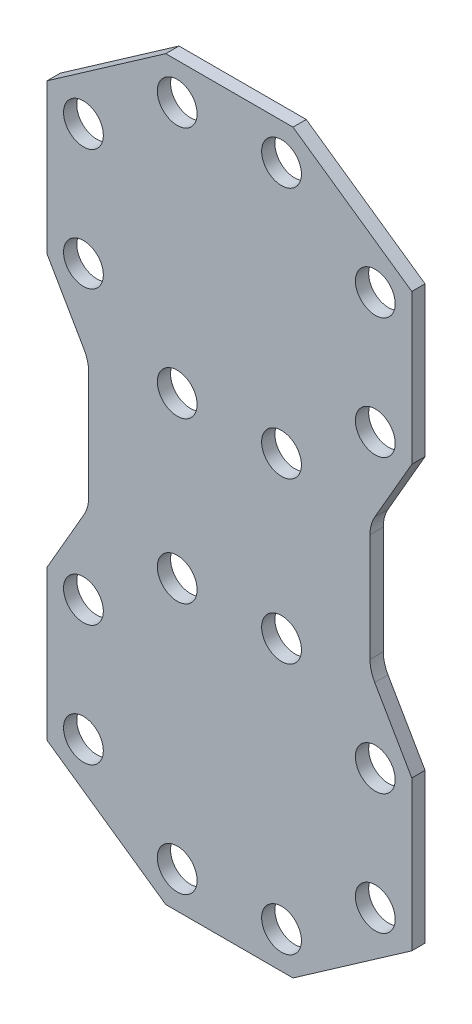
from build123d import *

# Parameters (mm, degrees)
MAIN_PLATE_DEPTH   = 38.1
SKETCH5_R          = 57.15
CUT_EXTRUDE1_DEPTH = 38.1


with BuildPart() as part:
    # Sketch3 → Main Plate (new body)
    with BuildSketch(Plane(origin=(0, 0, 0), x_dir=(0, 1, 0), z_dir=(0, 0, 1))):
        with BuildLine():
            Line((201.663107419, -523.855268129), (-228.234235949, -523.855268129))
            Line((-228.234235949, -523.855268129), (-466.324268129, -182.70492307))
            Line((-466.324268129, -182.70492307), (-466.324268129, 182.70492307))
            Line((-466.324268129, 182.70492307), (-228.234235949, 523.855268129))
            Line((-228.234235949, 523.855268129), (201.663107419, 523.855268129))
            Line((201.663107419, 523.855268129), (385.932842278, 417.467087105))
            ThreePointArc((385.932842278, 417.467087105), (410.436827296, 407.317204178), (436.732842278, 403.855268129))
            Line((436.732842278, 403.855268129), (746.653157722, 403.855268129))
            ThreePointArc((746.653157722, 403.855268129), (772.949172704, 407.317204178), (797.453157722, 417.467087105))
            Line((797.453157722, 417.467087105), (981.722892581, 523.855268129))
            Line((981.722892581, 523.855268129), (1411.620235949, 523.855268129))
            Line((1411.620235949, 523.855268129), (1649.710268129, 182.70492307))
            Line((1649.710268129, 182.70492307), (1649.710268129, -182.70492307))
            Line((1649.710268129, -182.70492307), (1411.620235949, -523.855268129))
            Line((1411.620235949, -523.855268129), (981.722892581, -523.855268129))
            Line((981.722892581, -523.855268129), (797.453157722, -417.467087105))
            ThreePointArc((797.453157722, -417.467087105), (772.949172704, -407.317204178), (746.653157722, -403.855268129))
            Line((746.653157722, -403.855268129), (436.732842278, -403.855268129))
            ThreePointArc((436.732842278, -403.855268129), (410.436827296, -407.317204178), (385.932842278, -417.467087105))
            Line((385.932842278, -417.467087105), (201.663107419, -523.855268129))
        make_face()
    extrude(amount=MAIN_PLATE_DEPTH)

    # Sketch5 → Cut-Extrude1 (cut)
    with BuildSketch(Plane(origin=(0, 0, 0), x_dir=(0, 1, 0), z_dir=(0, 0, 1))):
        with Locations(Location((-173.588730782, 419.080268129, 0), (0, 0, 270))):
            Circle(SKETCH5_R)
        with Locations(Location((173.588730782, 419.080268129, 0), (0, 0, 270))):
            Circle(SKETCH5_R)
        with Locations(Location((361.549268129, 149.758610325, 0), (0, 0, 270))):
            Circle(SKETCH5_R)
        with Locations(Location((361.549268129, -149.758610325, 0), (0, 0, 270))):
            Circle(SKETCH5_R)
        with Locations(Location((173.588730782, -419.080268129, 0), (0, 0, 270))):
            Circle(SKETCH5_R)
        with Locations(Location((-173.588730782, -419.080268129, 0), (0, 0, 270))):
            Circle(SKETCH5_R)
        with Locations(Location((-361.549268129, -149.758610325, 0), (0, 0, 270))):
            Circle(SKETCH5_R)
        with Locations(Location((-361.549268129, 149.758610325, 0), (0, 0, 270))):
            Circle(SKETCH5_R)
        with Locations(Location((821.836731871, 149.758610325, 0), (0, 0, 270))):
            Circle(SKETCH5_R)
        with Locations(Location((1544.935268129, -149.758610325, 0), (0, 0, 270))):
            Circle(SKETCH5_R)
        with Locations(Location((821.836731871, -149.758610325, 0), (0, 0, 270))):
            Circle(SKETCH5_R)
        with Locations(Location((1356.974730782, -419.080268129, 0), (0, 0, 270))):
            Circle(SKETCH5_R)
        with Locations(Location((1009.797269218, -419.080268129, 0), (0, 0, 270))):
            Circle(SKETCH5_R)
        with Locations(Location((1356.974730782, 419.080268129, 0), (0, 0, 270))):
            Circle(SKETCH5_R)
        with Locations(Location((1544.935268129, 149.758610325, 0), (0, 0, 270))):
            Circle(SKETCH5_R)
        with Locations(Location((1009.797269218, 419.080268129, 0), (0, 0, 270))):
            Circle(SKETCH5_R)
    extrude(amount=CUT_EXTRUDE1_DEPTH, mode=Mode.SUBTRACT)


solid = part.part
